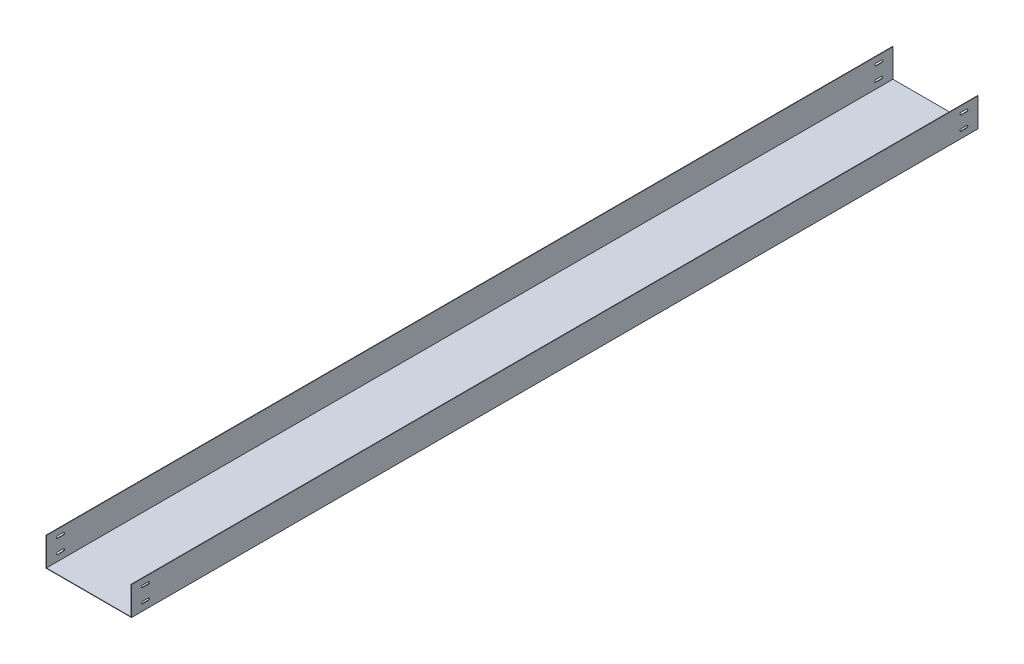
ISO-10303-21;
HEADER;
FILE_DESCRIPTION(('STEP AP214'),'2;1');
FILE_NAME('part.step','',(''),(''),'','','');
FILE_SCHEMA(('AUTOMOTIVE_DESIGN { 1 0 10303 214 1 1 1 1 }'));
ENDSEC;
DATA;
#1=APPLICATION_CONTEXT('core data for automotive mechanical design processes');
#2=APPLICATION_PROTOCOL_DEFINITION('international standard','automotive_design',2000,#1);
#3=PRODUCT_CONTEXT('',#1,'mechanical');
#4=PRODUCT('Part','Part','',(#3));
#5=PRODUCT_RELATED_PRODUCT_CATEGORY('part','',(#4));
#6=PRODUCT_DEFINITION_FORMATION('','',#4);
#7=PRODUCT_DEFINITION_CONTEXT('part definition',#1,'design');
#8=PRODUCT_DEFINITION('design','',#6,#7);
#9=PRODUCT_DEFINITION_SHAPE('','',#8);
#10=(LENGTH_UNIT() NAMED_UNIT(*) SI_UNIT(.MILLI.,.METRE.));
#11=(NAMED_UNIT(*) PLANE_ANGLE_UNIT() SI_UNIT($,.RADIAN.));
#12=(NAMED_UNIT(*) SI_UNIT($,.STERADIAN.) SOLID_ANGLE_UNIT());
#13=UNCERTAINTY_MEASURE_WITH_UNIT(LENGTH_MEASURE(1.E-05),#10,'distance_accuracy_value','');
#14=(GEOMETRIC_REPRESENTATION_CONTEXT(3) GLOBAL_UNCERTAINTY_ASSIGNED_CONTEXT((#13)) GLOBAL_UNIT_ASSIGNED_CONTEXT((#10,
#11,#12)) REPRESENTATION_CONTEXT('',''));
#15=CARTESIAN_POINT('',(0.,0.,0.));
#16=DIRECTION('',(0.,0.,1.));
#17=DIRECTION('',(1.,0.,0.));
#18=AXIS2_PLACEMENT_3D('',#15,#16,#17);
#19=CARTESIAN_POINT('',(151.5,0.,3000.));
#20=DIRECTION('',(-1.,0.,0.));
#21=DIRECTION('',(0.,0.,1.));
#22=AXIS2_PLACEMENT_3D('',#19,#20,#21);
#23=PLANE('',#22);
#24=DIRECTION('',(0.,0.,-1.));
#25=VECTOR('',#24,1.);
#26=CARTESIAN_POINT('',(151.5,21.,2960.));
#27=LINE('',#26,#25);
#28=CARTESIAN_POINT('',(151.5,21.,2960.));
#29=VERTEX_POINT('',#28);
#30=CARTESIAN_POINT('',(151.5,21.,2940.));
#31=VERTEX_POINT('',#30);
#32=EDGE_CURVE('E301',#29,#31,#27,.T.);
#33=ORIENTED_EDGE('',*,*,#32,.F.);
#34=CARTESIAN_POINT('',(151.5,25.,2960.));
#35=DIRECTION('',(1.,0.,0.));
#36=DIRECTION('',(0.,0.,-1.));
#37=AXIS2_PLACEMENT_3D('',#34,#35,#36);
#38=CIRCLE('',#37,4.);
#39=CARTESIAN_POINT('',(151.5,29.,2960.));
#40=VERTEX_POINT('',#39);
#41=EDGE_CURVE('E48',#40,#29,#38,.T.);
#42=ORIENTED_EDGE('',*,*,#41,.F.);
#43=DIRECTION('',(0.,0.,1.));
#44=VECTOR('',#43,1.);
#45=CARTESIAN_POINT('',(151.5,29.,2960.));
#46=LINE('',#45,#44);
#47=CARTESIAN_POINT('',(151.5,29.,2940.));
#48=VERTEX_POINT('',#47);
#49=EDGE_CURVE('E308',#48,#40,#46,.T.);
#50=ORIENTED_EDGE('',*,*,#49,.F.);
#51=CARTESIAN_POINT('',(151.5,25.,2940.));
#52=DIRECTION('',(1.,0.,0.));
#53=DIRECTION('',(0.,0.,-1.));
#54=AXIS2_PLACEMENT_3D('',#51,#52,#53);
#55=CIRCLE('',#54,4.);
#56=EDGE_CURVE('E292',#31,#48,#55,.T.);
#57=ORIENTED_EDGE('',*,*,#56,.F.);
#58=EDGE_LOOP('',(#33,#42,#50,#57));
#59=FACE_BOUND('',#58,.T.);
#60=DIRECTION('',(0.,0.,-1.));
#61=VECTOR('',#60,1.);
#62=CARTESIAN_POINT('',(151.5,71.,2960.));
#63=LINE('',#62,#61);
#64=CARTESIAN_POINT('',(151.5,71.,2960.));
#65=VERTEX_POINT('',#64);
#66=CARTESIAN_POINT('',(151.5,71.,2940.));
#67=VERTEX_POINT('',#66);
#68=EDGE_CURVE('E353',#65,#67,#63,.T.);
#69=ORIENTED_EDGE('',*,*,#68,.F.);
#70=CARTESIAN_POINT('',(151.5,75.,2960.));
#71=DIRECTION('',(1.,0.,0.));
#72=DIRECTION('',(0.,0.,-1.));
#73=AXIS2_PLACEMENT_3D('',#70,#71,#72);
#74=CIRCLE('',#73,4.);
#75=CARTESIAN_POINT('',(151.5,79.,2960.));
#76=VERTEX_POINT('',#75);
#77=EDGE_CURVE('E351',#76,#65,#74,.T.);
#78=ORIENTED_EDGE('',*,*,#77,.F.);
#79=DIRECTION('',(0.,0.,1.));
#80=VECTOR('',#79,1.);
#81=CARTESIAN_POINT('',(151.5,79.,2960.));
#82=LINE('',#81,#80);
#83=CARTESIAN_POINT('',(151.5,79.,2940.));
#84=VERTEX_POINT('',#83);
#85=EDGE_CURVE('E359',#84,#76,#82,.T.);
#86=ORIENTED_EDGE('',*,*,#85,.F.);
#87=CARTESIAN_POINT('',(151.5,75.,2940.));
#88=DIRECTION('',(1.,0.,0.));
#89=DIRECTION('',(0.,0.,-1.));
#90=AXIS2_PLACEMENT_3D('',#87,#88,#89);
#91=CIRCLE('',#90,4.);
#92=EDGE_CURVE('E356',#67,#84,#91,.T.);
#93=ORIENTED_EDGE('',*,*,#92,.F.);
#94=EDGE_LOOP('',(#69,#78,#86,#93));
#95=FACE_BOUND('',#94,.T.);
#96=DIRECTION('',(0.,0.,-1.));
#97=VECTOR('',#96,1.);
#98=CARTESIAN_POINT('',(151.5,21.,60.));
#99=LINE('',#98,#97);
#100=CARTESIAN_POINT('',(151.5,21.,60.0000000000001));
#101=VERTEX_POINT('',#100);
#102=CARTESIAN_POINT('',(151.5,21.,40.));
#103=VERTEX_POINT('',#102);
#104=EDGE_CURVE('E409',#101,#103,#99,.T.);
#105=ORIENTED_EDGE('',*,*,#104,.F.);
#106=CARTESIAN_POINT('',(151.5,25.,60.));
#107=DIRECTION('',(1.,0.,0.));
#108=DIRECTION('',(0.,0.,-1.));
#109=AXIS2_PLACEMENT_3D('',#106,#107,#108);
#110=CIRCLE('',#109,4.);
#111=CARTESIAN_POINT('',(151.5,29.,60.));
#112=VERTEX_POINT('',#111);
#113=EDGE_CURVE('E407',#112,#101,#110,.T.);
#114=ORIENTED_EDGE('',*,*,#113,.F.);
#115=DIRECTION('',(0.,0.,1.));
#116=VECTOR('',#115,1.);
#117=CARTESIAN_POINT('',(151.5,29.,60.));
#118=LINE('',#117,#116);
#119=CARTESIAN_POINT('',(151.5,29.,40.));
#120=VERTEX_POINT('',#119);
#121=EDGE_CURVE('E415',#120,#112,#118,.T.);
#122=ORIENTED_EDGE('',*,*,#121,.F.);
#123=CARTESIAN_POINT('',(151.5,25.,40.));
#124=DIRECTION('',(1.,0.,0.));
#125=DIRECTION('',(0.,0.,-1.));
#126=AXIS2_PLACEMENT_3D('',#123,#124,#125);
#127=CIRCLE('',#126,4.);
#128=EDGE_CURVE('E412',#103,#120,#127,.T.);
#129=ORIENTED_EDGE('',*,*,#128,.F.);
#130=EDGE_LOOP('',(#105,#114,#122,#129));
#131=FACE_BOUND('',#130,.T.);
#132=DIRECTION('',(0.,0.,-1.));
#133=VECTOR('',#132,1.);
#134=CARTESIAN_POINT('',(151.5,71.,60.));
#135=LINE('',#134,#133);
#136=CARTESIAN_POINT('',(151.5,71.,60.0000000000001));
#137=VERTEX_POINT('',#136);
#138=CARTESIAN_POINT('',(151.5,71.,40.));
#139=VERTEX_POINT('',#138);
#140=EDGE_CURVE('E465',#137,#139,#135,.T.);
#141=ORIENTED_EDGE('',*,*,#140,.F.);
#142=CARTESIAN_POINT('',(151.5,75.,60.));
#143=DIRECTION('',(1.,0.,0.));
#144=DIRECTION('',(0.,0.,-1.));
#145=AXIS2_PLACEMENT_3D('',#142,#143,#144);
#146=CIRCLE('',#145,4.);
#147=CARTESIAN_POINT('',(151.5,79.,60.));
#148=VERTEX_POINT('',#147);
#149=EDGE_CURVE('E463',#148,#137,#146,.T.);
#150=ORIENTED_EDGE('',*,*,#149,.F.);
#151=DIRECTION('',(0.,0.,1.));
#152=VECTOR('',#151,1.);
#153=CARTESIAN_POINT('',(151.5,79.,60.));
#154=LINE('',#153,#152);
#155=CARTESIAN_POINT('',(151.5,79.,40.));
#156=VERTEX_POINT('',#155);
#157=EDGE_CURVE('E471',#156,#148,#154,.T.);
#158=ORIENTED_EDGE('',*,*,#157,.F.);
#159=CARTESIAN_POINT('',(151.5,75.,40.));
#160=DIRECTION('',(1.,0.,0.));
#161=DIRECTION('',(0.,0.,-1.));
#162=AXIS2_PLACEMENT_3D('',#159,#160,#161);
#163=CIRCLE('',#162,4.);
#164=EDGE_CURVE('E468',#139,#156,#163,.T.);
#165=ORIENTED_EDGE('',*,*,#164,.F.);
#166=EDGE_LOOP('',(#141,#150,#158,#165));
#167=FACE_BOUND('',#166,.T.);
#168=DIRECTION('',(0.,1.,0.));
#169=VECTOR('',#168,1.);
#170=CARTESIAN_POINT('',(151.5,0.,0.));
#171=LINE('',#170,#169);
#172=CARTESIAN_POINT('',(151.5,-1.5,0.));
#173=VERTEX_POINT('',#172);
#174=CARTESIAN_POINT('',(151.5,100.,0.));
#175=VERTEX_POINT('',#174);
#176=EDGE_CURVE('E519',#173,#175,#171,.T.);
#177=ORIENTED_EDGE('',*,*,#176,.T.);
#178=DIRECTION('',(0.,0.,-1.));
#179=VECTOR('',#178,1.);
#180=CARTESIAN_POINT('',(151.5,100.,3000.));
#181=LINE('',#180,#179);
#182=CARTESIAN_POINT('',(151.5,100.,3000.));
#183=VERTEX_POINT('',#182);
#184=EDGE_CURVE('E11',#183,#175,#181,.T.);
#185=ORIENTED_EDGE('',*,*,#184,.F.);
#186=DIRECTION('',(0.,1.,0.));
#187=VECTOR('',#186,1.);
#188=CARTESIAN_POINT('',(151.5,0.,3000.));
#189=LINE('',#188,#187);
#190=CARTESIAN_POINT('',(151.5,-1.5,3000.));
#191=VERTEX_POINT('',#190);
#192=EDGE_CURVE('E520',#191,#183,#189,.T.);
#193=ORIENTED_EDGE('',*,*,#192,.F.);
#194=DIRECTION('',(0.,0.,-1.));
#195=VECTOR('',#194,1.);
#196=CARTESIAN_POINT('',(151.5,-1.5,3000.));
#197=LINE('',#196,#195);
#198=EDGE_CURVE('E542',#191,#173,#197,.T.);
#199=ORIENTED_EDGE('',*,*,#198,.T.);
#200=EDGE_LOOP('',(#177,#185,#193,#199));
#201=FACE_BOUND('',#200,.T.);
#202=ADVANCED_FACE('F34',(#59,#95,#131,#167,#201),#23,.F.);
#203=CARTESIAN_POINT('',(150.,100.,3000.));
#204=DIRECTION('',(0.,1.,0.));
#205=DIRECTION('',(0.,0.,1.));
#206=AXIS2_PLACEMENT_3D('',#203,#204,#205);
#207=PLANE('',#206);
#208=DIRECTION('',(1.,0.,0.));
#209=VECTOR('',#208,1.);
#210=CARTESIAN_POINT('',(150.,100.,0.));
#211=LINE('',#210,#209);
#212=CARTESIAN_POINT('',(150.,100.,0.));
#213=VERTEX_POINT('',#212);
#214=EDGE_CURVE('E545',#213,#175,#211,.T.);
#215=ORIENTED_EDGE('',*,*,#214,.F.);
#216=DIRECTION('',(0.,0.,-1.));
#217=VECTOR('',#216,1.);
#218=CARTESIAN_POINT('',(150.,100.,3000.));
#219=LINE('',#218,#217);
#220=CARTESIAN_POINT('',(150.,100.,3000.));
#221=VERTEX_POINT('',#220);
#222=EDGE_CURVE('E41',#221,#213,#219,.T.);
#223=ORIENTED_EDGE('',*,*,#222,.F.);
#224=DIRECTION('',(1.,0.,0.));
#225=VECTOR('',#224,1.);
#226=CARTESIAN_POINT('',(150.,100.,3000.));
#227=LINE('',#226,#225);
#228=EDGE_CURVE('E522',#221,#183,#227,.T.);
#229=ORIENTED_EDGE('',*,*,#228,.T.);
#230=ORIENTED_EDGE('',*,*,#184,.T.);
#231=EDGE_LOOP('',(#215,#223,#229,#230));
#232=FACE_BOUND('',#231,.T.);
#233=ADVANCED_FACE('F582',(#232),#207,.T.);
#234=CARTESIAN_POINT('',(150.,0.,3000.));
#235=DIRECTION('',(-1.,0.,0.));
#236=DIRECTION('',(0.,0.,1.));
#237=AXIS2_PLACEMENT_3D('',#234,#235,#236);
#238=PLANE('',#237);
#239=CARTESIAN_POINT('',(150.,25.,2960.));
#240=DIRECTION('',(-1.,0.,0.));
#241=DIRECTION('',(0.,0.,1.));
#242=AXIS2_PLACEMENT_3D('',#239,#240,#241);
#243=CIRCLE('',#242,4.);
#244=CARTESIAN_POINT('',(150.,21.,2960.));
#245=VERTEX_POINT('',#244);
#246=CARTESIAN_POINT('',(150.,29.,2960.));
#247=VERTEX_POINT('',#246);
#248=EDGE_CURVE('E349',#245,#247,#243,.T.);
#249=ORIENTED_EDGE('',*,*,#248,.F.);
#250=DIRECTION('',(0.,0.,1.));
#251=VECTOR('',#250,1.);
#252=CARTESIAN_POINT('',(150.,21.,3000.));
#253=LINE('',#252,#251);
#254=CARTESIAN_POINT('',(150.,21.,2940.));
#255=VERTEX_POINT('',#254);
#256=EDGE_CURVE('E337',#255,#245,#253,.T.);
#257=ORIENTED_EDGE('',*,*,#256,.F.);
#258=CARTESIAN_POINT('',(150.,25.,2940.));
#259=DIRECTION('',(-1.,0.,0.));
#260=DIRECTION('',(0.,0.,1.));
#261=AXIS2_PLACEMENT_3D('',#258,#259,#260);
#262=CIRCLE('',#261,4.);
#263=CARTESIAN_POINT('',(150.,29.,2940.));
#264=VERTEX_POINT('',#263);
#265=EDGE_CURVE('E295',#264,#255,#262,.T.);
#266=ORIENTED_EDGE('',*,*,#265,.F.);
#267=DIRECTION('',(0.,0.,-1.));
#268=VECTOR('',#267,1.);
#269=CARTESIAN_POINT('',(150.,29.,3000.));
#270=LINE('',#269,#268);
#271=EDGE_CURVE('E344',#247,#264,#270,.T.);
#272=ORIENTED_EDGE('',*,*,#271,.F.);
#273=EDGE_LOOP('',(#249,#257,#266,#272));
#274=FACE_BOUND('',#273,.T.);
#275=CARTESIAN_POINT('',(150.,75.,2960.));
#276=DIRECTION('',(-1.,0.,0.));
#277=DIRECTION('',(0.,0.,1.));
#278=AXIS2_PLACEMENT_3D('',#275,#276,#277);
#279=CIRCLE('',#278,4.);
#280=CARTESIAN_POINT('',(150.,71.,2960.));
#281=VERTEX_POINT('',#280);
#282=CARTESIAN_POINT('',(150.,79.,2960.));
#283=VERTEX_POINT('',#282);
#284=EDGE_CURVE('E405',#281,#283,#279,.T.);
#285=ORIENTED_EDGE('',*,*,#284,.F.);
#286=DIRECTION('',(0.,0.,1.));
#287=VECTOR('',#286,1.);
#288=CARTESIAN_POINT('',(150.,71.,3000.));
#289=LINE('',#288,#287);
#290=CARTESIAN_POINT('',(150.,71.,2940.));
#291=VERTEX_POINT('',#290);
#292=EDGE_CURVE('E391',#291,#281,#289,.T.);
#293=ORIENTED_EDGE('',*,*,#292,.F.);
#294=CARTESIAN_POINT('',(150.,75.,2940.));
#295=DIRECTION('',(-1.,0.,0.));
#296=DIRECTION('',(0.,0.,1.));
#297=AXIS2_PLACEMENT_3D('',#294,#295,#296);
#298=CIRCLE('',#297,4.);
#299=CARTESIAN_POINT('',(150.,79.,2940.));
#300=VERTEX_POINT('',#299);
#301=EDGE_CURVE('E395',#300,#291,#298,.T.);
#302=ORIENTED_EDGE('',*,*,#301,.F.);
#303=DIRECTION('',(0.,0.,-1.));
#304=VECTOR('',#303,1.);
#305=CARTESIAN_POINT('',(150.,79.,3000.));
#306=LINE('',#305,#304);
#307=EDGE_CURVE('E400',#283,#300,#306,.T.);
#308=ORIENTED_EDGE('',*,*,#307,.F.);
#309=EDGE_LOOP('',(#285,#293,#302,#308));
#310=FACE_BOUND('',#309,.T.);
#311=CARTESIAN_POINT('',(150.,25.,60.));
#312=DIRECTION('',(-1.,0.,0.));
#313=DIRECTION('',(0.,0.,1.));
#314=AXIS2_PLACEMENT_3D('',#311,#312,#313);
#315=CIRCLE('',#314,4.);
#316=CARTESIAN_POINT('',(150.,21.,60.));
#317=VERTEX_POINT('',#316);
#318=CARTESIAN_POINT('',(150.,29.,60.));
#319=VERTEX_POINT('',#318);
#320=EDGE_CURVE('E461',#317,#319,#315,.T.);
#321=ORIENTED_EDGE('',*,*,#320,.F.);
#322=DIRECTION('',(0.,0.,1.));
#323=VECTOR('',#322,1.);
#324=CARTESIAN_POINT('',(150.,20.9999999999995,3000.));
#325=LINE('',#324,#323);
#326=CARTESIAN_POINT('',(150.,21.,40.));
#327=VERTEX_POINT('',#326);
#328=EDGE_CURVE('E447',#327,#317,#325,.T.);
#329=ORIENTED_EDGE('',*,*,#328,.F.);
#330=CARTESIAN_POINT('',(150.,25.,40.));
#331=DIRECTION('',(-1.,0.,0.));
#332=DIRECTION('',(0.,0.,1.));
#333=AXIS2_PLACEMENT_3D('',#330,#331,#332);
#334=CIRCLE('',#333,4.);
#335=CARTESIAN_POINT('',(150.,29.,40.));
#336=VERTEX_POINT('',#335);
#337=EDGE_CURVE('E451',#336,#327,#334,.T.);
#338=ORIENTED_EDGE('',*,*,#337,.F.);
#339=DIRECTION('',(0.,0.,-1.));
#340=VECTOR('',#339,1.);
#341=CARTESIAN_POINT('',(150.,28.9999999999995,3000.));
#342=LINE('',#341,#340);
#343=EDGE_CURVE('E456',#319,#336,#342,.T.);
#344=ORIENTED_EDGE('',*,*,#343,.F.);
#345=EDGE_LOOP('',(#321,#329,#338,#344));
#346=FACE_BOUND('',#345,.T.);
#347=CARTESIAN_POINT('',(150.,75.,60.));
#348=DIRECTION('',(-1.,0.,0.));
#349=DIRECTION('',(0.,0.,1.));
#350=AXIS2_PLACEMENT_3D('',#347,#348,#349);
#351=CIRCLE('',#350,4.);
#352=CARTESIAN_POINT('',(150.,71.,60.));
#353=VERTEX_POINT('',#352);
#354=CARTESIAN_POINT('',(150.,79.,60.));
#355=VERTEX_POINT('',#354);
#356=EDGE_CURVE('E517',#353,#355,#351,.T.);
#357=ORIENTED_EDGE('',*,*,#356,.F.);
#358=DIRECTION('',(0.,0.,1.));
#359=VECTOR('',#358,1.);
#360=CARTESIAN_POINT('',(150.,71.,3000.));
#361=LINE('',#360,#359);
#362=CARTESIAN_POINT('',(150.,71.,40.));
#363=VERTEX_POINT('',#362);
#364=EDGE_CURVE('E503',#363,#353,#361,.T.);
#365=ORIENTED_EDGE('',*,*,#364,.F.);
#366=CARTESIAN_POINT('',(150.,75.,40.));
#367=DIRECTION('',(-1.,0.,0.));
#368=DIRECTION('',(0.,0.,1.));
#369=AXIS2_PLACEMENT_3D('',#366,#367,#368);
#370=CIRCLE('',#369,4.);
#371=CARTESIAN_POINT('',(150.,79.,40.));
#372=VERTEX_POINT('',#371);
#373=EDGE_CURVE('E507',#372,#363,#370,.T.);
#374=ORIENTED_EDGE('',*,*,#373,.F.);
#375=DIRECTION('',(0.,0.,-1.));
#376=VECTOR('',#375,1.);
#377=CARTESIAN_POINT('',(150.,79.,3000.));
#378=LINE('',#377,#376);
#379=EDGE_CURVE('E512',#355,#372,#378,.T.);
#380=ORIENTED_EDGE('',*,*,#379,.F.);
#381=EDGE_LOOP('',(#357,#365,#374,#380));
#382=FACE_BOUND('',#381,.T.);
#383=DIRECTION('',(0.,1.,0.));
#384=VECTOR('',#383,1.);
#385=CARTESIAN_POINT('',(150.,0.,0.));
#386=LINE('',#385,#384);
#387=CARTESIAN_POINT('',(150.,0.,0.));
#388=VERTEX_POINT('',#387);
#389=EDGE_CURVE('E548',#388,#213,#386,.T.);
#390=ORIENTED_EDGE('',*,*,#389,.F.);
#391=DIRECTION('',(0.,0.,-1.));
#392=VECTOR('',#391,1.);
#393=CARTESIAN_POINT('',(150.,0.,3000.));
#394=LINE('',#393,#392);
#395=CARTESIAN_POINT('',(150.,0.,3000.));
#396=VERTEX_POINT('',#395);
#397=EDGE_CURVE('E574',#396,#388,#394,.T.);
#398=ORIENTED_EDGE('',*,*,#397,.F.);
#399=DIRECTION('',(0.,1.,0.));
#400=VECTOR('',#399,1.);
#401=CARTESIAN_POINT('',(150.,0.,3000.));
#402=LINE('',#401,#400);
#403=EDGE_CURVE('E526',#396,#221,#402,.T.);
#404=ORIENTED_EDGE('',*,*,#403,.T.);
#405=ORIENTED_EDGE('',*,*,#222,.T.);
#406=EDGE_LOOP('',(#390,#398,#404,#405));
#407=FACE_BOUND('',#406,.T.);
#408=ADVANCED_FACE('F578',(#274,#310,#346,#382,#407),#238,.T.);
#409=CARTESIAN_POINT('',(-150.,0.,3000.));
#410=DIRECTION('',(0.,1.,0.));
#411=DIRECTION('',(0.,0.,1.));
#412=AXIS2_PLACEMENT_3D('',#409,#410,#411);
#413=PLANE('',#412);
#414=DIRECTION('',(1.,0.,0.));
#415=VECTOR('',#414,1.);
#416=CARTESIAN_POINT('',(-150.,0.,0.));
#417=LINE('',#416,#415);
#418=CARTESIAN_POINT('',(-150.,0.,0.));
#419=VERTEX_POINT('',#418);
#420=EDGE_CURVE('E551',#419,#388,#417,.T.);
#421=ORIENTED_EDGE('',*,*,#420,.F.);
#422=DIRECTION('',(0.,0.,-1.));
#423=VECTOR('',#422,1.);
#424=CARTESIAN_POINT('',(-150.,0.,3000.));
#425=LINE('',#424,#423);
#426=CARTESIAN_POINT('',(-150.,0.,3000.));
#427=VERTEX_POINT('',#426);
#428=EDGE_CURVE('E572',#427,#419,#425,.T.);
#429=ORIENTED_EDGE('',*,*,#428,.F.);
#430=DIRECTION('',(1.,0.,0.));
#431=VECTOR('',#430,1.);
#432=CARTESIAN_POINT('',(-150.,0.,3000.));
#433=LINE('',#432,#431);
#434=EDGE_CURVE('E529',#427,#396,#433,.T.);
#435=ORIENTED_EDGE('',*,*,#434,.T.);
#436=ORIENTED_EDGE('',*,*,#397,.T.);
#437=EDGE_LOOP('',(#421,#429,#435,#436));
#438=FACE_BOUND('',#437,.T.);
#439=ADVANCED_FACE('F590',(#438),#413,.T.);
#440=CARTESIAN_POINT('',(-150.,0.,3000.));
#441=DIRECTION('',(1.,0.,0.));
#442=DIRECTION('',(0.,0.,-1.));
#443=AXIS2_PLACEMENT_3D('',#440,#441,#442);
#444=PLANE('',#443);
#445=CARTESIAN_POINT('',(-150.,25.,2960.));
#446=DIRECTION('',(1.,0.,0.));
#447=DIRECTION('',(0.,0.,-1.));
#448=AXIS2_PLACEMENT_3D('',#445,#446,#447);
#449=CIRCLE('',#448,4.);
#450=CARTESIAN_POINT('',(-150.,29.,2960.));
#451=VERTEX_POINT('',#450);
#452=CARTESIAN_POINT('',(-150.,21.,2960.));
#453=VERTEX_POINT('',#452);
#454=EDGE_CURVE('E346',#451,#453,#449,.T.);
#455=ORIENTED_EDGE('',*,*,#454,.F.);
#456=DIRECTION('',(0.,0.,1.));
#457=VECTOR('',#456,1.);
#458=CARTESIAN_POINT('',(-150.,29.,3000.));
#459=LINE('',#458,#457);
#460=CARTESIAN_POINT('',(-150.,29.,2940.));
#461=VERTEX_POINT('',#460);
#462=EDGE_CURVE('E342',#461,#451,#459,.T.);
#463=ORIENTED_EDGE('',*,*,#462,.F.);
#464=CARTESIAN_POINT('',(-150.,25.,2940.));
#465=DIRECTION('',(1.,0.,0.));
#466=DIRECTION('',(0.,0.,-1.));
#467=AXIS2_PLACEMENT_3D('',#464,#465,#466);
#468=CIRCLE('',#467,4.);
#469=CARTESIAN_POINT('',(-150.,21.,2940.));
#470=VERTEX_POINT('',#469);
#471=EDGE_CURVE('E339',#470,#461,#468,.T.);
#472=ORIENTED_EDGE('',*,*,#471,.F.);
#473=DIRECTION('',(0.,0.,-1.));
#474=VECTOR('',#473,1.);
#475=CARTESIAN_POINT('',(-150.,21.,3000.));
#476=LINE('',#475,#474);
#477=EDGE_CURVE('E328',#453,#470,#476,.T.);
#478=ORIENTED_EDGE('',*,*,#477,.F.);
#479=EDGE_LOOP('',(#455,#463,#472,#478));
#480=FACE_BOUND('',#479,.T.);
#481=CARTESIAN_POINT('',(-150.,75.,2960.));
#482=DIRECTION('',(1.,0.,0.));
#483=DIRECTION('',(0.,0.,-1.));
#484=AXIS2_PLACEMENT_3D('',#481,#482,#483);
#485=CIRCLE('',#484,4.);
#486=CARTESIAN_POINT('',(-150.,79.,2960.));
#487=VERTEX_POINT('',#486);
#488=CARTESIAN_POINT('',(-150.,71.,2960.));
#489=VERTEX_POINT('',#488);
#490=EDGE_CURVE('E402',#487,#489,#485,.T.);
#491=ORIENTED_EDGE('',*,*,#490,.F.);
#492=DIRECTION('',(0.,0.,1.));
#493=VECTOR('',#492,1.);
#494=CARTESIAN_POINT('',(-150.,79.,3000.));
#495=LINE('',#494,#493);
#496=CARTESIAN_POINT('',(-150.,79.,2940.));
#497=VERTEX_POINT('',#496);
#498=EDGE_CURVE('E398',#497,#487,#495,.T.);
#499=ORIENTED_EDGE('',*,*,#498,.F.);
#500=CARTESIAN_POINT('',(-150.,75.,2940.));
#501=DIRECTION('',(1.,0.,0.));
#502=DIRECTION('',(0.,0.,-1.));
#503=AXIS2_PLACEMENT_3D('',#500,#501,#502);
#504=CIRCLE('',#503,4.);
#505=CARTESIAN_POINT('',(-150.,71.,2940.));
#506=VERTEX_POINT('',#505);
#507=EDGE_CURVE('E393',#506,#497,#504,.T.);
#508=ORIENTED_EDGE('',*,*,#507,.F.);
#509=DIRECTION('',(0.,0.,-1.));
#510=VECTOR('',#509,1.);
#511=CARTESIAN_POINT('',(-150.,71.,3000.));
#512=LINE('',#511,#510);
#513=EDGE_CURVE('E378',#489,#506,#512,.T.);
#514=ORIENTED_EDGE('',*,*,#513,.F.);
#515=EDGE_LOOP('',(#491,#499,#508,#514));
#516=FACE_BOUND('',#515,.T.);
#517=CARTESIAN_POINT('',(-150.,25.,60.));
#518=DIRECTION('',(1.,0.,0.));
#519=DIRECTION('',(0.,0.,-1.));
#520=AXIS2_PLACEMENT_3D('',#517,#518,#519);
#521=CIRCLE('',#520,4.);
#522=CARTESIAN_POINT('',(-150.,29.,60.));
#523=VERTEX_POINT('',#522);
#524=CARTESIAN_POINT('',(-150.,21.,60.0000000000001));
#525=VERTEX_POINT('',#524);
#526=EDGE_CURVE('E458',#523,#525,#521,.T.);
#527=ORIENTED_EDGE('',*,*,#526,.F.);
#528=DIRECTION('',(0.,0.,1.));
#529=VECTOR('',#528,1.);
#530=CARTESIAN_POINT('',(-150.,28.9999999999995,3000.));
#531=LINE('',#530,#529);
#532=CARTESIAN_POINT('',(-150.,29.,40.));
#533=VERTEX_POINT('',#532);
#534=EDGE_CURVE('E454',#533,#523,#531,.T.);
#535=ORIENTED_EDGE('',*,*,#534,.F.);
#536=CARTESIAN_POINT('',(-150.,25.,40.));
#537=DIRECTION('',(1.,0.,0.));
#538=DIRECTION('',(0.,0.,-1.));
#539=AXIS2_PLACEMENT_3D('',#536,#537,#538);
#540=CIRCLE('',#539,4.);
#541=CARTESIAN_POINT('',(-150.,21.,40.));
#542=VERTEX_POINT('',#541);
#543=EDGE_CURVE('E449',#542,#533,#540,.T.);
#544=ORIENTED_EDGE('',*,*,#543,.F.);
#545=DIRECTION('',(0.,0.,-1.));
#546=VECTOR('',#545,1.);
#547=CARTESIAN_POINT('',(-150.,20.9999999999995,3000.));
#548=LINE('',#547,#546);
#549=EDGE_CURVE('E434',#525,#542,#548,.T.);
#550=ORIENTED_EDGE('',*,*,#549,.F.);
#551=EDGE_LOOP('',(#527,#535,#544,#550));
#552=FACE_BOUND('',#551,.T.);
#553=CARTESIAN_POINT('',(-150.,75.,60.));
#554=DIRECTION('',(1.,0.,0.));
#555=DIRECTION('',(0.,0.,-1.));
#556=AXIS2_PLACEMENT_3D('',#553,#554,#555);
#557=CIRCLE('',#556,4.);
#558=CARTESIAN_POINT('',(-150.,79.,60.));
#559=VERTEX_POINT('',#558);
#560=CARTESIAN_POINT('',(-150.,71.,60.0000000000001));
#561=VERTEX_POINT('',#560);
#562=EDGE_CURVE('E514',#559,#561,#557,.T.);
#563=ORIENTED_EDGE('',*,*,#562,.F.);
#564=DIRECTION('',(0.,0.,1.));
#565=VECTOR('',#564,1.);
#566=CARTESIAN_POINT('',(-150.,79.,3000.));
#567=LINE('',#566,#565);
#568=CARTESIAN_POINT('',(-150.,79.,40.));
#569=VERTEX_POINT('',#568);
#570=EDGE_CURVE('E510',#569,#559,#567,.T.);
#571=ORIENTED_EDGE('',*,*,#570,.F.);
#572=CARTESIAN_POINT('',(-150.,75.,40.));
#573=DIRECTION('',(1.,0.,0.));
#574=DIRECTION('',(0.,0.,-1.));
#575=AXIS2_PLACEMENT_3D('',#572,#573,#574);
#576=CIRCLE('',#575,4.);
#577=CARTESIAN_POINT('',(-150.,71.,40.));
#578=VERTEX_POINT('',#577);
#579=EDGE_CURVE('E505',#578,#569,#576,.T.);
#580=ORIENTED_EDGE('',*,*,#579,.F.);
#581=DIRECTION('',(0.,0.,-1.));
#582=VECTOR('',#581,1.);
#583=CARTESIAN_POINT('',(-150.,71.,3000.));
#584=LINE('',#583,#582);
#585=EDGE_CURVE('E490',#561,#578,#584,.T.);
#586=ORIENTED_EDGE('',*,*,#585,.F.);
#587=EDGE_LOOP('',(#563,#571,#580,#586));
#588=FACE_BOUND('',#587,.T.);
#589=DIRECTION('',(0.,-1.,0.));
#590=VECTOR('',#589,1.);
#591=CARTESIAN_POINT('',(-150.,0.,0.));
#592=LINE('',#591,#590);
#593=CARTESIAN_POINT('',(-150.,100.,0.));
#594=VERTEX_POINT('',#593);
#595=EDGE_CURVE('E554',#594,#419,#592,.T.);
#596=ORIENTED_EDGE('',*,*,#595,.F.);
#597=DIRECTION('',(0.,0.,-1.));
#598=VECTOR('',#597,1.);
#599=CARTESIAN_POINT('',(-150.,100.,3000.));
#600=LINE('',#599,#598);
#601=CARTESIAN_POINT('',(-150.,100.,3000.));
#602=VERTEX_POINT('',#601);
#603=EDGE_CURVE('E570',#602,#594,#600,.T.);
#604=ORIENTED_EDGE('',*,*,#603,.F.);
#605=DIRECTION('',(0.,-1.,0.));
#606=VECTOR('',#605,1.);
#607=CARTESIAN_POINT('',(-150.,0.,3000.));
#608=LINE('',#607,#606);
#609=EDGE_CURVE('E532',#602,#427,#608,.T.);
#610=ORIENTED_EDGE('',*,*,#609,.T.);
#611=ORIENTED_EDGE('',*,*,#428,.T.);
#612=EDGE_LOOP('',(#596,#604,#610,#611));
#613=FACE_BOUND('',#612,.T.);
#614=ADVANCED_FACE('F612',(#480,#516,#552,#588,#613),#444,.T.);
#615=CARTESIAN_POINT('',(-151.5,100.,3000.));
#616=DIRECTION('',(0.,1.,0.));
#617=DIRECTION('',(0.,0.,1.));
#618=AXIS2_PLACEMENT_3D('',#615,#616,#617);
#619=PLANE('',#618);
#620=DIRECTION('',(1.,0.,0.));
#621=VECTOR('',#620,1.);
#622=CARTESIAN_POINT('',(-151.5,100.,0.));
#623=LINE('',#622,#621);
#624=CARTESIAN_POINT('',(-151.5,100.,0.));
#625=VERTEX_POINT('',#624);
#626=EDGE_CURVE('E557',#625,#594,#623,.T.);
#627=ORIENTED_EDGE('',*,*,#626,.F.);
#628=DIRECTION('',(0.,0.,-1.));
#629=VECTOR('',#628,1.);
#630=CARTESIAN_POINT('',(-151.5,100.,3000.));
#631=LINE('',#630,#629);
#632=CARTESIAN_POINT('',(-151.5,100.,3000.));
#633=VERTEX_POINT('',#632);
#634=EDGE_CURVE('E568',#633,#625,#631,.T.);
#635=ORIENTED_EDGE('',*,*,#634,.F.);
#636=DIRECTION('',(1.,0.,0.));
#637=VECTOR('',#636,1.);
#638=CARTESIAN_POINT('',(-151.5,100.,3000.));
#639=LINE('',#638,#637);
#640=EDGE_CURVE('E535',#633,#602,#639,.T.);
#641=ORIENTED_EDGE('',*,*,#640,.T.);
#642=ORIENTED_EDGE('',*,*,#603,.T.);
#643=EDGE_LOOP('',(#627,#635,#641,#642));
#644=FACE_BOUND('',#643,.T.);
#645=ADVANCED_FACE('F610',(#644),#619,.T.);
#646=CARTESIAN_POINT('',(-151.5,0.,3000.));
#647=DIRECTION('',(1.,0.,0.));
#648=DIRECTION('',(0.,0.,-1.));
#649=AXIS2_PLACEMENT_3D('',#646,#647,#648);
#650=PLANE('',#649);
#651=DIRECTION('',(0.,0.,1.));
#652=VECTOR('',#651,1.);
#653=CARTESIAN_POINT('',(-151.5,29.,2960.));
#654=LINE('',#653,#652);
#655=CARTESIAN_POINT('',(-151.5,29.,2940.));
#656=VERTEX_POINT('',#655);
#657=CARTESIAN_POINT('',(-151.5,29.,2960.));
#658=VERTEX_POINT('',#657);
#659=EDGE_CURVE('E322',#656,#658,#654,.T.);
#660=ORIENTED_EDGE('',*,*,#659,.T.);
#661=CARTESIAN_POINT('',(-151.5,25.,2960.));
#662=DIRECTION('',(1.,0.,0.));
#663=DIRECTION('',(0.,0.,-1.));
#664=AXIS2_PLACEMENT_3D('',#661,#662,#663);
#665=CIRCLE('',#664,4.);
#666=CARTESIAN_POINT('',(-151.5,21.,2960.));
#667=VERTEX_POINT('',#666);
#668=EDGE_CURVE('E310',#658,#667,#665,.T.);
#669=ORIENTED_EDGE('',*,*,#668,.T.);
#670=DIRECTION('',(0.,0.,-1.));
#671=VECTOR('',#670,1.);
#672=CARTESIAN_POINT('',(-151.5,21.,2960.));
#673=LINE('',#672,#671);
#674=CARTESIAN_POINT('',(-151.5,21.,2940.));
#675=VERTEX_POINT('',#674);
#676=EDGE_CURVE('E316',#667,#675,#673,.T.);
#677=ORIENTED_EDGE('',*,*,#676,.T.);
#678=CARTESIAN_POINT('',(-151.5,25.,2940.));
#679=DIRECTION('',(1.,0.,0.));
#680=DIRECTION('',(0.,0.,-1.));
#681=AXIS2_PLACEMENT_3D('',#678,#679,#680);
#682=CIRCLE('',#681,4.);
#683=EDGE_CURVE('E319',#675,#656,#682,.T.);
#684=ORIENTED_EDGE('',*,*,#683,.T.);
#685=EDGE_LOOP('',(#660,#669,#677,#684));
#686=FACE_BOUND('',#685,.T.);
#687=DIRECTION('',(0.,0.,1.));
#688=VECTOR('',#687,1.);
#689=CARTESIAN_POINT('',(-151.5,79.,2960.));
#690=LINE('',#689,#688);
#691=CARTESIAN_POINT('',(-151.5,79.,2940.));
#692=VERTEX_POINT('',#691);
#693=CARTESIAN_POINT('',(-151.5,79.,2960.));
#694=VERTEX_POINT('',#693);
#695=EDGE_CURVE('E371',#692,#694,#690,.T.);
#696=ORIENTED_EDGE('',*,*,#695,.T.);
#697=CARTESIAN_POINT('',(-151.5,75.,2960.));
#698=DIRECTION('',(1.,0.,0.));
#699=DIRECTION('',(0.,0.,-1.));
#700=AXIS2_PLACEMENT_3D('',#697,#698,#699);
#701=CIRCLE('',#700,4.);
#702=CARTESIAN_POINT('',(-151.5,71.,2960.));
#703=VERTEX_POINT('',#702);
#704=EDGE_CURVE('E362',#694,#703,#701,.T.);
#705=ORIENTED_EDGE('',*,*,#704,.T.);
#706=DIRECTION('',(0.,0.,-1.));
#707=VECTOR('',#706,1.);
#708=CARTESIAN_POINT('',(-151.5,71.,2960.));
#709=LINE('',#708,#707);
#710=CARTESIAN_POINT('',(-151.5,71.,2940.));
#711=VERTEX_POINT('',#710);
#712=EDGE_CURVE('E365',#703,#711,#709,.T.);
#713=ORIENTED_EDGE('',*,*,#712,.T.);
#714=CARTESIAN_POINT('',(-151.5,75.,2940.));
#715=DIRECTION('',(1.,0.,0.));
#716=DIRECTION('',(0.,0.,-1.));
#717=AXIS2_PLACEMENT_3D('',#714,#715,#716);
#718=CIRCLE('',#717,4.);
#719=EDGE_CURVE('E368',#711,#692,#718,.T.);
#720=ORIENTED_EDGE('',*,*,#719,.T.);
#721=EDGE_LOOP('',(#696,#705,#713,#720));
#722=FACE_BOUND('',#721,.T.);
#723=DIRECTION('',(0.,0.,1.));
#724=VECTOR('',#723,1.);
#725=CARTESIAN_POINT('',(-151.5,29.,60.));
#726=LINE('',#725,#724);
#727=CARTESIAN_POINT('',(-151.5,29.,40.));
#728=VERTEX_POINT('',#727);
#729=CARTESIAN_POINT('',(-151.5,29.,60.));
#730=VERTEX_POINT('',#729);
#731=EDGE_CURVE('E427',#728,#730,#726,.T.);
#732=ORIENTED_EDGE('',*,*,#731,.T.);
#733=CARTESIAN_POINT('',(-151.5,25.,60.));
#734=DIRECTION('',(1.,0.,0.));
#735=DIRECTION('',(0.,0.,-1.));
#736=AXIS2_PLACEMENT_3D('',#733,#734,#735);
#737=CIRCLE('',#736,4.);
#738=CARTESIAN_POINT('',(-151.5,21.,60.));
#739=VERTEX_POINT('',#738);
#740=EDGE_CURVE('E418',#730,#739,#737,.T.);
#741=ORIENTED_EDGE('',*,*,#740,.T.);
#742=DIRECTION('',(0.,0.,-1.));
#743=VECTOR('',#742,1.);
#744=CARTESIAN_POINT('',(-151.5,21.,60.));
#745=LINE('',#744,#743);
#746=CARTESIAN_POINT('',(-151.5,21.,40.));
#747=VERTEX_POINT('',#746);
#748=EDGE_CURVE('E421',#739,#747,#745,.T.);
#749=ORIENTED_EDGE('',*,*,#748,.T.);
#750=CARTESIAN_POINT('',(-151.5,25.,40.));
#751=DIRECTION('',(1.,0.,0.));
#752=DIRECTION('',(0.,0.,-1.));
#753=AXIS2_PLACEMENT_3D('',#750,#751,#752);
#754=CIRCLE('',#753,4.);
#755=EDGE_CURVE('E424',#747,#728,#754,.T.);
#756=ORIENTED_EDGE('',*,*,#755,.T.);
#757=EDGE_LOOP('',(#732,#741,#749,#756));
#758=FACE_BOUND('',#757,.T.);
#759=DIRECTION('',(0.,0.,1.));
#760=VECTOR('',#759,1.);
#761=CARTESIAN_POINT('',(-151.5,79.,60.));
#762=LINE('',#761,#760);
#763=CARTESIAN_POINT('',(-151.5,79.,40.));
#764=VERTEX_POINT('',#763);
#765=CARTESIAN_POINT('',(-151.5,79.,60.));
#766=VERTEX_POINT('',#765);
#767=EDGE_CURVE('E483',#764,#766,#762,.T.);
#768=ORIENTED_EDGE('',*,*,#767,.T.);
#769=CARTESIAN_POINT('',(-151.5,75.,60.));
#770=DIRECTION('',(1.,0.,0.));
#771=DIRECTION('',(0.,0.,-1.));
#772=AXIS2_PLACEMENT_3D('',#769,#770,#771);
#773=CIRCLE('',#772,4.);
#774=CARTESIAN_POINT('',(-151.5,71.,60.));
#775=VERTEX_POINT('',#774);
#776=EDGE_CURVE('E474',#766,#775,#773,.T.);
#777=ORIENTED_EDGE('',*,*,#776,.T.);
#778=DIRECTION('',(0.,0.,-1.));
#779=VECTOR('',#778,1.);
#780=CARTESIAN_POINT('',(-151.5,71.,60.));
#781=LINE('',#780,#779);
#782=CARTESIAN_POINT('',(-151.5,71.,40.));
#783=VERTEX_POINT('',#782);
#784=EDGE_CURVE('E477',#775,#783,#781,.T.);
#785=ORIENTED_EDGE('',*,*,#784,.T.);
#786=CARTESIAN_POINT('',(-151.5,75.,40.));
#787=DIRECTION('',(1.,0.,0.));
#788=DIRECTION('',(0.,0.,-1.));
#789=AXIS2_PLACEMENT_3D('',#786,#787,#788);
#790=CIRCLE('',#789,4.);
#791=EDGE_CURVE('E480',#783,#764,#790,.T.);
#792=ORIENTED_EDGE('',*,*,#791,.T.);
#793=EDGE_LOOP('',(#768,#777,#785,#792));
#794=FACE_BOUND('',#793,.T.);
#795=DIRECTION('',(0.,1.,0.));
#796=VECTOR('',#795,1.);
#797=CARTESIAN_POINT('',(-151.5,0.,0.));
#798=LINE('',#797,#796);
#799=CARTESIAN_POINT('',(-151.5,-1.5,0.));
#800=VERTEX_POINT('',#799);
#801=EDGE_CURVE('E560',#625,#800,#798,.F.);
#802=ORIENTED_EDGE('',*,*,#801,.T.);
#803=DIRECTION('',(0.,0.,-1.));
#804=VECTOR('',#803,1.);
#805=CARTESIAN_POINT('',(-151.5,-1.5,3000.));
#806=LINE('',#805,#804);
#807=CARTESIAN_POINT('',(-151.5,-1.5,3000.));
#808=VERTEX_POINT('',#807);
#809=EDGE_CURVE('E565',#808,#800,#806,.T.);
#810=ORIENTED_EDGE('',*,*,#809,.F.);
#811=DIRECTION('',(0.,1.,0.));
#812=VECTOR('',#811,1.);
#813=CARTESIAN_POINT('',(-151.5,0.,3000.));
#814=LINE('',#813,#812);
#815=EDGE_CURVE('E538',#633,#808,#814,.F.);
#816=ORIENTED_EDGE('',*,*,#815,.F.);
#817=ORIENTED_EDGE('',*,*,#634,.T.);
#818=EDGE_LOOP('',(#802,#810,#816,#817));
#819=FACE_BOUND('',#818,.T.);
#820=ADVANCED_FACE('F607',(#686,#722,#758,#794,#819),#650,.F.);
#821=CARTESIAN_POINT('',(-150.,-1.5,3000.));
#822=DIRECTION('',(0.,1.,0.));
#823=DIRECTION('',(0.,0.,1.));
#824=AXIS2_PLACEMENT_3D('',#821,#822,#823);
#825=PLANE('',#824);
#826=DIRECTION('',(1.,0.,0.));
#827=VECTOR('',#826,1.);
#828=CARTESIAN_POINT('',(-150.,-1.5,0.));
#829=LINE('',#828,#827);
#830=EDGE_CURVE('E523',#800,#173,#829,.T.);
#831=ORIENTED_EDGE('',*,*,#830,.T.);
#832=ORIENTED_EDGE('',*,*,#198,.F.);
#833=DIRECTION('',(1.,0.,0.));
#834=VECTOR('',#833,1.);
#835=CARTESIAN_POINT('',(-150.,-1.5,3000.));
#836=LINE('',#835,#834);
#837=EDGE_CURVE('E540',#808,#191,#836,.T.);
#838=ORIENTED_EDGE('',*,*,#837,.F.);
#839=ORIENTED_EDGE('',*,*,#809,.T.);
#840=EDGE_LOOP('',(#831,#832,#838,#839));
#841=FACE_BOUND('',#840,.T.);
#842=ADVANCED_FACE('F603',(#841),#825,.F.);
#843=CARTESIAN_POINT('',(0.,0.,3000.));
#844=DIRECTION('',(0.,0.,-1.));
#845=DIRECTION('',(-1.,0.,0.));
#846=AXIS2_PLACEMENT_3D('',#843,#844,#845);
#847=PLANE('',#846);
#848=ORIENTED_EDGE('',*,*,#192,.T.);
#849=ORIENTED_EDGE('',*,*,#228,.F.);
#850=ORIENTED_EDGE('',*,*,#403,.F.);
#851=ORIENTED_EDGE('',*,*,#434,.F.);
#852=ORIENTED_EDGE('',*,*,#609,.F.);
#853=ORIENTED_EDGE('',*,*,#640,.F.);
#854=ORIENTED_EDGE('',*,*,#815,.T.);
#855=ORIENTED_EDGE('',*,*,#837,.T.);
#856=EDGE_LOOP('',(#848,#849,#850,#851,#852,#853,#854,#855));
#857=FACE_BOUND('',#856,.T.);
#858=ADVANCED_FACE('F593',(#857),#847,.F.);
#859=CARTESIAN_POINT('',(0.,0.,0.));
#860=DIRECTION('',(0.,0.,-1.));
#861=DIRECTION('',(-1.,0.,0.));
#862=AXIS2_PLACEMENT_3D('',#859,#860,#861);
#863=PLANE('',#862);
#864=ORIENTED_EDGE('',*,*,#176,.F.);
#865=ORIENTED_EDGE('',*,*,#830,.F.);
#866=ORIENTED_EDGE('',*,*,#801,.F.);
#867=ORIENTED_EDGE('',*,*,#626,.T.);
#868=ORIENTED_EDGE('',*,*,#595,.T.);
#869=ORIENTED_EDGE('',*,*,#420,.T.);
#870=ORIENTED_EDGE('',*,*,#389,.T.);
#871=ORIENTED_EDGE('',*,*,#214,.T.);
#872=EDGE_LOOP('',(#864,#865,#866,#867,#868,#869,#870,#871));
#873=FACE_BOUND('',#872,.T.);
#874=ADVANCED_FACE('F586',(#873),#863,.T.);
#875=CARTESIAN_POINT('',(-151.5,71.,60.));
#876=DIRECTION('',(0.,-1.,0.));
#877=DIRECTION('',(0.,0.,-1.));
#878=AXIS2_PLACEMENT_3D('',#875,#876,#877);
#879=PLANE('',#878);
#880=ORIENTED_EDGE('',*,*,#585,.T.);
#881=DIRECTION('',(1.,0.,0.));
#882=VECTOR('',#881,1.);
#883=CARTESIAN_POINT('',(-151.5,71.,40.));
#884=LINE('',#883,#882);
#885=EDGE_CURVE('E496',#783,#578,#884,.T.);
#886=ORIENTED_EDGE('',*,*,#885,.F.);
#887=ORIENTED_EDGE('',*,*,#784,.F.);
#888=DIRECTION('',(1.,0.,0.));
#889=VECTOR('',#888,1.);
#890=CARTESIAN_POINT('',(-151.5,71.,60.));
#891=LINE('',#890,#889);
#892=EDGE_CURVE('E500',#775,#561,#891,.T.);
#893=ORIENTED_EDGE('',*,*,#892,.T.);
#894=EDGE_LOOP('',(#880,#886,#887,#893));
#895=FACE_BOUND('',#894,.T.);
#896=ADVANCED_FACE('F676',(#895),#879,.F.);
#897=CARTESIAN_POINT('',(-151.5,75.,40.));
#898=DIRECTION('',(1.,0.,0.));
#899=DIRECTION('',(0.,0.,-1.));
#900=AXIS2_PLACEMENT_3D('',#897,#898,#899);
#901=CYLINDRICAL_SURFACE('',#900,4.);
#902=ORIENTED_EDGE('',*,*,#579,.T.);
#903=DIRECTION('',(1.,0.,0.));
#904=VECTOR('',#903,1.);
#905=CARTESIAN_POINT('',(-151.5,79.,40.));
#906=LINE('',#905,#904);
#907=EDGE_CURVE('E492',#764,#569,#906,.T.);
#908=ORIENTED_EDGE('',*,*,#907,.F.);
#909=ORIENTED_EDGE('',*,*,#791,.F.);
#910=ORIENTED_EDGE('',*,*,#885,.T.);
#911=EDGE_LOOP('',(#902,#908,#909,#910));
#912=FACE_BOUND('',#911,.T.);
#913=ADVANCED_FACE('F669',(#912),#901,.F.);
#914=CARTESIAN_POINT('',(-151.5,79.,60.));
#915=DIRECTION('',(0.,1.,0.));
#916=DIRECTION('',(0.,0.,1.));
#917=AXIS2_PLACEMENT_3D('',#914,#915,#916);
#918=PLANE('',#917);
#919=ORIENTED_EDGE('',*,*,#570,.T.);
#920=DIRECTION('',(1.,0.,0.));
#921=VECTOR('',#920,1.);
#922=CARTESIAN_POINT('',(-151.5,79.,60.));
#923=LINE('',#922,#921);
#924=EDGE_CURVE('E487',#766,#559,#923,.T.);
#925=ORIENTED_EDGE('',*,*,#924,.F.);
#926=ORIENTED_EDGE('',*,*,#767,.F.);
#927=ORIENTED_EDGE('',*,*,#907,.T.);
#928=EDGE_LOOP('',(#919,#925,#926,#927));
#929=FACE_BOUND('',#928,.T.);
#930=ADVANCED_FACE('F678',(#929),#918,.F.);
#931=CARTESIAN_POINT('',(-151.5,75.,60.));
#932=DIRECTION('',(1.,0.,0.));
#933=DIRECTION('',(0.,0.,-1.));
#934=AXIS2_PLACEMENT_3D('',#931,#932,#933);
#935=CYLINDRICAL_SURFACE('',#934,4.);
#936=ORIENTED_EDGE('',*,*,#562,.T.);
#937=ORIENTED_EDGE('',*,*,#892,.F.);
#938=ORIENTED_EDGE('',*,*,#776,.F.);
#939=ORIENTED_EDGE('',*,*,#924,.T.);
#940=EDGE_LOOP('',(#936,#937,#938,#939));
#941=FACE_BOUND('',#940,.T.);
#942=ADVANCED_FACE('F685',(#941),#935,.F.);
#943=ORIENTED_EDGE('',*,*,#356,.T.);
#944=EDGE_CURVE('E491',#355,#148,#923,.T.);
#945=ORIENTED_EDGE('',*,*,#944,.T.);
#946=ORIENTED_EDGE('',*,*,#149,.T.);
#947=EDGE_CURVE('E486',#353,#137,#891,.T.);
#948=ORIENTED_EDGE('',*,*,#947,.F.);
#949=EDGE_LOOP('',(#943,#945,#946,#948));
#950=FACE_BOUND('',#949,.T.);
#951=ADVANCED_FACE('F653',(#950),#935,.F.);
#952=ORIENTED_EDGE('',*,*,#379,.T.);
#953=EDGE_CURVE('E495',#372,#156,#906,.T.);
#954=ORIENTED_EDGE('',*,*,#953,.T.);
#955=ORIENTED_EDGE('',*,*,#157,.T.);
#956=ORIENTED_EDGE('',*,*,#944,.F.);
#957=EDGE_LOOP('',(#952,#954,#955,#956));
#958=FACE_BOUND('',#957,.T.);
#959=ADVANCED_FACE('F656',(#958),#918,.F.);
#960=ORIENTED_EDGE('',*,*,#373,.T.);
#961=EDGE_CURVE('E499',#363,#139,#884,.T.);
#962=ORIENTED_EDGE('',*,*,#961,.T.);
#963=ORIENTED_EDGE('',*,*,#164,.T.);
#964=ORIENTED_EDGE('',*,*,#953,.F.);
#965=EDGE_LOOP('',(#960,#962,#963,#964));
#966=FACE_BOUND('',#965,.T.);
#967=ADVANCED_FACE('F666',(#966),#901,.F.);
#968=ORIENTED_EDGE('',*,*,#364,.T.);
#969=ORIENTED_EDGE('',*,*,#947,.T.);
#970=ORIENTED_EDGE('',*,*,#140,.T.);
#971=ORIENTED_EDGE('',*,*,#961,.F.);
#972=EDGE_LOOP('',(#968,#969,#970,#971));
#973=FACE_BOUND('',#972,.T.);
#974=ADVANCED_FACE('F664',(#973),#879,.F.);
#975=CARTESIAN_POINT('',(-151.5,21.,60.));
#976=DIRECTION('',(0.,-1.,0.));
#977=DIRECTION('',(0.,0.,-1.));
#978=AXIS2_PLACEMENT_3D('',#975,#976,#977);
#979=PLANE('',#978);
#980=ORIENTED_EDGE('',*,*,#549,.T.);
#981=DIRECTION('',(1.,0.,0.));
#982=VECTOR('',#981,1.);
#983=CARTESIAN_POINT('',(-151.5,21.,40.));
#984=LINE('',#983,#982);
#985=EDGE_CURVE('E440',#747,#542,#984,.T.);
#986=ORIENTED_EDGE('',*,*,#985,.F.);
#987=ORIENTED_EDGE('',*,*,#748,.F.);
#988=DIRECTION('',(1.,0.,0.));
#989=VECTOR('',#988,1.);
#990=CARTESIAN_POINT('',(-151.5,21.,60.));
#991=LINE('',#990,#989);
#992=EDGE_CURVE('E444',#739,#525,#991,.T.);
#993=ORIENTED_EDGE('',*,*,#992,.T.);
#994=EDGE_LOOP('',(#980,#986,#987,#993));
#995=FACE_BOUND('',#994,.T.);
#996=ADVANCED_FACE('F674',(#995),#979,.F.);
#997=CARTESIAN_POINT('',(-151.5,25.,40.));
#998=DIRECTION('',(1.,0.,0.));
#999=DIRECTION('',(0.,0.,-1.));
#1000=AXIS2_PLACEMENT_3D('',#997,#998,#999);
#1001=CYLINDRICAL_SURFACE('',#1000,4.);
#1002=ORIENTED_EDGE('',*,*,#543,.T.);
#1003=DIRECTION('',(1.,0.,0.));
#1004=VECTOR('',#1003,1.);
#1005=CARTESIAN_POINT('',(-151.5,29.,40.));
#1006=LINE('',#1005,#1004);
#1007=EDGE_CURVE('E436',#728,#533,#1006,.T.);
#1008=ORIENTED_EDGE('',*,*,#1007,.F.);
#1009=ORIENTED_EDGE('',*,*,#755,.F.);
#1010=ORIENTED_EDGE('',*,*,#985,.T.);
#1011=EDGE_LOOP('',(#1002,#1008,#1009,#1010));
#1012=FACE_BOUND('',#1011,.T.);
#1013=ADVANCED_FACE('F741',(#1012),#1001,.F.);
#1014=CARTESIAN_POINT('',(-151.5,29.,60.));
#1015=DIRECTION('',(0.,1.,0.));
#1016=DIRECTION('',(0.,0.,1.));
#1017=AXIS2_PLACEMENT_3D('',#1014,#1015,#1016);
#1018=PLANE('',#1017);
#1019=ORIENTED_EDGE('',*,*,#534,.T.);
#1020=DIRECTION('',(1.,0.,0.));
#1021=VECTOR('',#1020,1.);
#1022=CARTESIAN_POINT('',(-151.5,29.,60.));
#1023=LINE('',#1022,#1021);
#1024=EDGE_CURVE('E431',#730,#523,#1023,.T.);
#1025=ORIENTED_EDGE('',*,*,#1024,.F.);
#1026=ORIENTED_EDGE('',*,*,#731,.F.);
#1027=ORIENTED_EDGE('',*,*,#1007,.T.);
#1028=EDGE_LOOP('',(#1019,#1025,#1026,#1027));
#1029=FACE_BOUND('',#1028,.T.);
#1030=ADVANCED_FACE('F752',(#1029),#1018,.F.);
#1031=CARTESIAN_POINT('',(-151.5,25.,60.));
#1032=DIRECTION('',(1.,0.,0.));
#1033=DIRECTION('',(0.,0.,-1.));
#1034=AXIS2_PLACEMENT_3D('',#1031,#1032,#1033);
#1035=CYLINDRICAL_SURFACE('',#1034,4.);
#1036=ORIENTED_EDGE('',*,*,#526,.T.);
#1037=ORIENTED_EDGE('',*,*,#992,.F.);
#1038=ORIENTED_EDGE('',*,*,#740,.F.);
#1039=ORIENTED_EDGE('',*,*,#1024,.T.);
#1040=EDGE_LOOP('',(#1036,#1037,#1038,#1039));
#1041=FACE_BOUND('',#1040,.T.);
#1042=ADVANCED_FACE('F763',(#1041),#1035,.F.);
#1043=ORIENTED_EDGE('',*,*,#320,.T.);
#1044=EDGE_CURVE('E435',#319,#112,#1023,.T.);
#1045=ORIENTED_EDGE('',*,*,#1044,.T.);
#1046=ORIENTED_EDGE('',*,*,#113,.T.);
#1047=EDGE_CURVE('E430',#317,#101,#991,.T.);
#1048=ORIENTED_EDGE('',*,*,#1047,.F.);
#1049=EDGE_LOOP('',(#1043,#1045,#1046,#1048));
#1050=FACE_BOUND('',#1049,.T.);
#1051=ADVANCED_FACE('F774',(#1050),#1035,.F.);
#1052=ORIENTED_EDGE('',*,*,#343,.T.);
#1053=EDGE_CURVE('E439',#336,#120,#1006,.T.);
#1054=ORIENTED_EDGE('',*,*,#1053,.T.);
#1055=ORIENTED_EDGE('',*,*,#121,.T.);
#1056=ORIENTED_EDGE('',*,*,#1044,.F.);
#1057=EDGE_LOOP('',(#1052,#1054,#1055,#1056));
#1058=FACE_BOUND('',#1057,.T.);
#1059=ADVANCED_FACE('F766',(#1058),#1018,.F.);
#1060=ORIENTED_EDGE('',*,*,#337,.T.);
#1061=EDGE_CURVE('E443',#327,#103,#984,.T.);
#1062=ORIENTED_EDGE('',*,*,#1061,.T.);
#1063=ORIENTED_EDGE('',*,*,#128,.T.);
#1064=ORIENTED_EDGE('',*,*,#1053,.F.);
#1065=EDGE_LOOP('',(#1060,#1062,#1063,#1064));
#1066=FACE_BOUND('',#1065,.T.);
#1067=ADVANCED_FACE('F755',(#1066),#1001,.F.);
#1068=ORIENTED_EDGE('',*,*,#328,.T.);
#1069=ORIENTED_EDGE('',*,*,#1047,.T.);
#1070=ORIENTED_EDGE('',*,*,#104,.T.);
#1071=ORIENTED_EDGE('',*,*,#1061,.F.);
#1072=EDGE_LOOP('',(#1068,#1069,#1070,#1071));
#1073=FACE_BOUND('',#1072,.T.);
#1074=ADVANCED_FACE('F744',(#1073),#979,.F.);
#1075=CARTESIAN_POINT('',(-151.5,71.,2960.));
#1076=DIRECTION('',(0.,-1.,0.));
#1077=DIRECTION('',(0.,0.,-1.));
#1078=AXIS2_PLACEMENT_3D('',#1075,#1076,#1077);
#1079=PLANE('',#1078);
#1080=ORIENTED_EDGE('',*,*,#513,.T.);
#1081=DIRECTION('',(1.,0.,0.));
#1082=VECTOR('',#1081,1.);
#1083=CARTESIAN_POINT('',(-151.5,71.,2940.));
#1084=LINE('',#1083,#1082);
#1085=EDGE_CURVE('E384',#711,#506,#1084,.T.);
#1086=ORIENTED_EDGE('',*,*,#1085,.F.);
#1087=ORIENTED_EDGE('',*,*,#712,.F.);
#1088=DIRECTION('',(1.,0.,0.));
#1089=VECTOR('',#1088,1.);
#1090=CARTESIAN_POINT('',(-151.5,71.,2960.));
#1091=LINE('',#1090,#1089);
#1092=EDGE_CURVE('E388',#703,#489,#1091,.T.);
#1093=ORIENTED_EDGE('',*,*,#1092,.T.);
#1094=EDGE_LOOP('',(#1080,#1086,#1087,#1093));
#1095=FACE_BOUND('',#1094,.T.);
#1096=ADVANCED_FACE('F807',(#1095),#1079,.F.);
#1097=CARTESIAN_POINT('',(-151.5,75.,2940.));
#1098=DIRECTION('',(1.,0.,0.));
#1099=DIRECTION('',(0.,0.,-1.));
#1100=AXIS2_PLACEMENT_3D('',#1097,#1098,#1099);
#1101=CYLINDRICAL_SURFACE('',#1100,4.);
#1102=ORIENTED_EDGE('',*,*,#507,.T.);
#1103=DIRECTION('',(1.,0.,0.));
#1104=VECTOR('',#1103,1.);
#1105=CARTESIAN_POINT('',(-151.5,79.,2940.));
#1106=LINE('',#1105,#1104);
#1107=EDGE_CURVE('E380',#692,#497,#1106,.T.);
#1108=ORIENTED_EDGE('',*,*,#1107,.F.);
#1109=ORIENTED_EDGE('',*,*,#719,.F.);
#1110=ORIENTED_EDGE('',*,*,#1085,.T.);
#1111=EDGE_LOOP('',(#1102,#1108,#1109,#1110));
#1112=FACE_BOUND('',#1111,.T.);
#1113=ADVANCED_FACE('F837',(#1112),#1101,.F.);
#1114=CARTESIAN_POINT('',(-151.5,79.,2960.));
#1115=DIRECTION('',(0.,1.,0.));
#1116=DIRECTION('',(0.,0.,1.));
#1117=AXIS2_PLACEMENT_3D('',#1114,#1115,#1116);
#1118=PLANE('',#1117);
#1119=ORIENTED_EDGE('',*,*,#498,.T.);
#1120=DIRECTION('',(1.,0.,0.));
#1121=VECTOR('',#1120,1.);
#1122=CARTESIAN_POINT('',(-151.5,79.,2960.));
#1123=LINE('',#1122,#1121);
#1124=EDGE_CURVE('E375',#694,#487,#1123,.T.);
#1125=ORIENTED_EDGE('',*,*,#1124,.F.);
#1126=ORIENTED_EDGE('',*,*,#695,.F.);
#1127=ORIENTED_EDGE('',*,*,#1107,.T.);
#1128=EDGE_LOOP('',(#1119,#1125,#1126,#1127));
#1129=FACE_BOUND('',#1128,.T.);
#1130=ADVANCED_FACE('F848',(#1129),#1118,.F.);
#1131=CARTESIAN_POINT('',(-151.5,75.,2960.));
#1132=DIRECTION('',(1.,0.,0.));
#1133=DIRECTION('',(0.,0.,-1.));
#1134=AXIS2_PLACEMENT_3D('',#1131,#1132,#1133);
#1135=CYLINDRICAL_SURFACE('',#1134,4.);
#1136=ORIENTED_EDGE('',*,*,#490,.T.);
#1137=ORIENTED_EDGE('',*,*,#1092,.F.);
#1138=ORIENTED_EDGE('',*,*,#704,.F.);
#1139=ORIENTED_EDGE('',*,*,#1124,.T.);
#1140=EDGE_LOOP('',(#1136,#1137,#1138,#1139));
#1141=FACE_BOUND('',#1140,.T.);
#1142=ADVANCED_FACE('F859',(#1141),#1135,.F.);
#1143=ORIENTED_EDGE('',*,*,#284,.T.);
#1144=EDGE_CURVE('E379',#283,#76,#1123,.T.);
#1145=ORIENTED_EDGE('',*,*,#1144,.T.);
#1146=ORIENTED_EDGE('',*,*,#77,.T.);
#1147=EDGE_CURVE('E374',#281,#65,#1091,.T.);
#1148=ORIENTED_EDGE('',*,*,#1147,.F.);
#1149=EDGE_LOOP('',(#1143,#1145,#1146,#1148));
#1150=FACE_BOUND('',#1149,.T.);
#1151=ADVANCED_FACE('F870',(#1150),#1135,.F.);
#1152=ORIENTED_EDGE('',*,*,#307,.T.);
#1153=EDGE_CURVE('E383',#300,#84,#1106,.T.);
#1154=ORIENTED_EDGE('',*,*,#1153,.T.);
#1155=ORIENTED_EDGE('',*,*,#85,.T.);
#1156=ORIENTED_EDGE('',*,*,#1144,.F.);
#1157=EDGE_LOOP('',(#1152,#1154,#1155,#1156));
#1158=FACE_BOUND('',#1157,.T.);
#1159=ADVANCED_FACE('F862',(#1158),#1118,.F.);
#1160=ORIENTED_EDGE('',*,*,#301,.T.);
#1161=EDGE_CURVE('E387',#291,#67,#1084,.T.);
#1162=ORIENTED_EDGE('',*,*,#1161,.T.);
#1163=ORIENTED_EDGE('',*,*,#92,.T.);
#1164=ORIENTED_EDGE('',*,*,#1153,.F.);
#1165=EDGE_LOOP('',(#1160,#1162,#1163,#1164));
#1166=FACE_BOUND('',#1165,.T.);
#1167=ADVANCED_FACE('F851',(#1166),#1101,.F.);
#1168=ORIENTED_EDGE('',*,*,#292,.T.);
#1169=ORIENTED_EDGE('',*,*,#1147,.T.);
#1170=ORIENTED_EDGE('',*,*,#68,.T.);
#1171=ORIENTED_EDGE('',*,*,#1161,.F.);
#1172=EDGE_LOOP('',(#1168,#1169,#1170,#1171));
#1173=FACE_BOUND('',#1172,.T.);
#1174=ADVANCED_FACE('F840',(#1173),#1079,.F.);
#1175=CARTESIAN_POINT('',(-151.5,21.,2960.));
#1176=DIRECTION('',(0.,-1.,0.));
#1177=DIRECTION('',(0.,0.,-1.));
#1178=AXIS2_PLACEMENT_3D('',#1175,#1176,#1177);
#1179=PLANE('',#1178);
#1180=ORIENTED_EDGE('',*,*,#477,.T.);
#1181=DIRECTION('',(1.,0.,0.));
#1182=VECTOR('',#1181,1.);
#1183=CARTESIAN_POINT('',(-151.5,21.,2940.));
#1184=LINE('',#1183,#1182);
#1185=EDGE_CURVE('E297',#675,#470,#1184,.T.);
#1186=ORIENTED_EDGE('',*,*,#1185,.F.);
#1187=ORIENTED_EDGE('',*,*,#676,.F.);
#1188=DIRECTION('',(1.,0.,0.));
#1189=VECTOR('',#1188,1.);
#1190=CARTESIAN_POINT('',(-151.5,21.,2960.));
#1191=LINE('',#1190,#1189);
#1192=EDGE_CURVE('E298',#667,#453,#1191,.T.);
#1193=ORIENTED_EDGE('',*,*,#1192,.T.);
#1194=EDGE_LOOP('',(#1180,#1186,#1187,#1193));
#1195=FACE_BOUND('',#1194,.T.);
#1196=ADVANCED_FACE('F904',(#1195),#1179,.F.);
#1197=CARTESIAN_POINT('',(-151.5,25.,2940.));
#1198=DIRECTION('',(1.,0.,0.));
#1199=DIRECTION('',(0.,0.,-1.));
#1200=AXIS2_PLACEMENT_3D('',#1197,#1198,#1199);
#1201=CYLINDRICAL_SURFACE('',#1200,4.);
#1202=ORIENTED_EDGE('',*,*,#471,.T.);
#1203=DIRECTION('',(1.,0.,0.));
#1204=VECTOR('',#1203,1.);
#1205=CARTESIAN_POINT('',(-151.5,29.,2940.));
#1206=LINE('',#1205,#1204);
#1207=EDGE_CURVE('E330',#656,#461,#1206,.T.);
#1208=ORIENTED_EDGE('',*,*,#1207,.F.);
#1209=ORIENTED_EDGE('',*,*,#683,.F.);
#1210=ORIENTED_EDGE('',*,*,#1185,.T.);
#1211=EDGE_LOOP('',(#1202,#1208,#1209,#1210));
#1212=FACE_BOUND('',#1211,.T.);
#1213=ADVANCED_FACE('F913',(#1212),#1201,.F.);
#1214=CARTESIAN_POINT('',(-151.5,29.,2960.));
#1215=DIRECTION('',(0.,1.,0.));
#1216=DIRECTION('',(0.,0.,1.));
#1217=AXIS2_PLACEMENT_3D('',#1214,#1215,#1216);
#1218=PLANE('',#1217);
#1219=ORIENTED_EDGE('',*,*,#462,.T.);
#1220=DIRECTION('',(1.,0.,0.));
#1221=VECTOR('',#1220,1.);
#1222=CARTESIAN_POINT('',(-151.5,29.,2960.));
#1223=LINE('',#1222,#1221);
#1224=EDGE_CURVE('E325',#658,#451,#1223,.T.);
#1225=ORIENTED_EDGE('',*,*,#1224,.F.);
#1226=ORIENTED_EDGE('',*,*,#659,.F.);
#1227=ORIENTED_EDGE('',*,*,#1207,.T.);
#1228=EDGE_LOOP('',(#1219,#1225,#1226,#1227));
#1229=FACE_BOUND('',#1228,.T.);
#1230=ADVANCED_FACE('F923',(#1229),#1218,.F.);
#1231=CARTESIAN_POINT('',(-151.5,25.,2960.));
#1232=DIRECTION('',(1.,0.,0.));
#1233=DIRECTION('',(0.,0.,-1.));
#1234=AXIS2_PLACEMENT_3D('',#1231,#1232,#1233);
#1235=CYLINDRICAL_SURFACE('',#1234,4.);
#1236=ORIENTED_EDGE('',*,*,#454,.T.);
#1237=ORIENTED_EDGE('',*,*,#1192,.F.);
#1238=ORIENTED_EDGE('',*,*,#668,.F.);
#1239=ORIENTED_EDGE('',*,*,#1224,.T.);
#1240=EDGE_LOOP('',(#1236,#1237,#1238,#1239));
#1241=FACE_BOUND('',#1240,.T.);
#1242=ADVANCED_FACE('F933',(#1241),#1235,.F.);
#1243=ORIENTED_EDGE('',*,*,#248,.T.);
#1244=EDGE_CURVE('E329',#247,#40,#1223,.T.);
#1245=ORIENTED_EDGE('',*,*,#1244,.T.);
#1246=ORIENTED_EDGE('',*,*,#41,.T.);
#1247=EDGE_CURVE('E303',#245,#29,#1191,.T.);
#1248=ORIENTED_EDGE('',*,*,#1247,.F.);
#1249=EDGE_LOOP('',(#1243,#1245,#1246,#1248));
#1250=FACE_BOUND('',#1249,.T.);
#1251=ADVANCED_FACE('F944',(#1250),#1235,.F.);
#1252=ORIENTED_EDGE('',*,*,#271,.T.);
#1253=EDGE_CURVE('E332',#264,#48,#1206,.T.);
#1254=ORIENTED_EDGE('',*,*,#1253,.T.);
#1255=ORIENTED_EDGE('',*,*,#49,.T.);
#1256=ORIENTED_EDGE('',*,*,#1244,.F.);
#1257=EDGE_LOOP('',(#1252,#1254,#1255,#1256));
#1258=FACE_BOUND('',#1257,.T.);
#1259=ADVANCED_FACE('F936',(#1258),#1218,.F.);
#1260=ORIENTED_EDGE('',*,*,#265,.T.);
#1261=EDGE_CURVE('E56',#255,#31,#1184,.T.);
#1262=ORIENTED_EDGE('',*,*,#1261,.T.);
#1263=ORIENTED_EDGE('',*,*,#56,.T.);
#1264=ORIENTED_EDGE('',*,*,#1253,.F.);
#1265=EDGE_LOOP('',(#1260,#1262,#1263,#1264));
#1266=FACE_BOUND('',#1265,.T.);
#1267=ADVANCED_FACE('F289',(#1266),#1201,.F.);
#1268=ORIENTED_EDGE('',*,*,#256,.T.);
#1269=ORIENTED_EDGE('',*,*,#1247,.T.);
#1270=ORIENTED_EDGE('',*,*,#32,.T.);
#1271=ORIENTED_EDGE('',*,*,#1261,.F.);
#1272=EDGE_LOOP('',(#1268,#1269,#1270,#1271));
#1273=FACE_BOUND('',#1272,.T.);
#1274=ADVANCED_FACE('F302',(#1273),#1179,.F.);
#1275=CLOSED_SHELL('',(#202,#233,#408,#439,#614,#645,#820,#842,#858,#874,#896,#913,#930,#942,
#951,#959,#967,#974,#996,#1013,#1030,#1042,#1051,#1059,#1067,#1074,#1096,#1113,#1130,#1142,
#1151,#1159,#1167,#1174,#1196,#1213,#1230,#1242,#1251,#1259,#1267,#1274));
#1276=MANIFOLD_SOLID_BREP('B2',#1275);
#1277=ADVANCED_BREP_SHAPE_REPRESENTATION('',(#18,#1276),#14);
#1278=SHAPE_DEFINITION_REPRESENTATION(#9,#1277);
ENDSEC;
END-ISO-10303-21;
